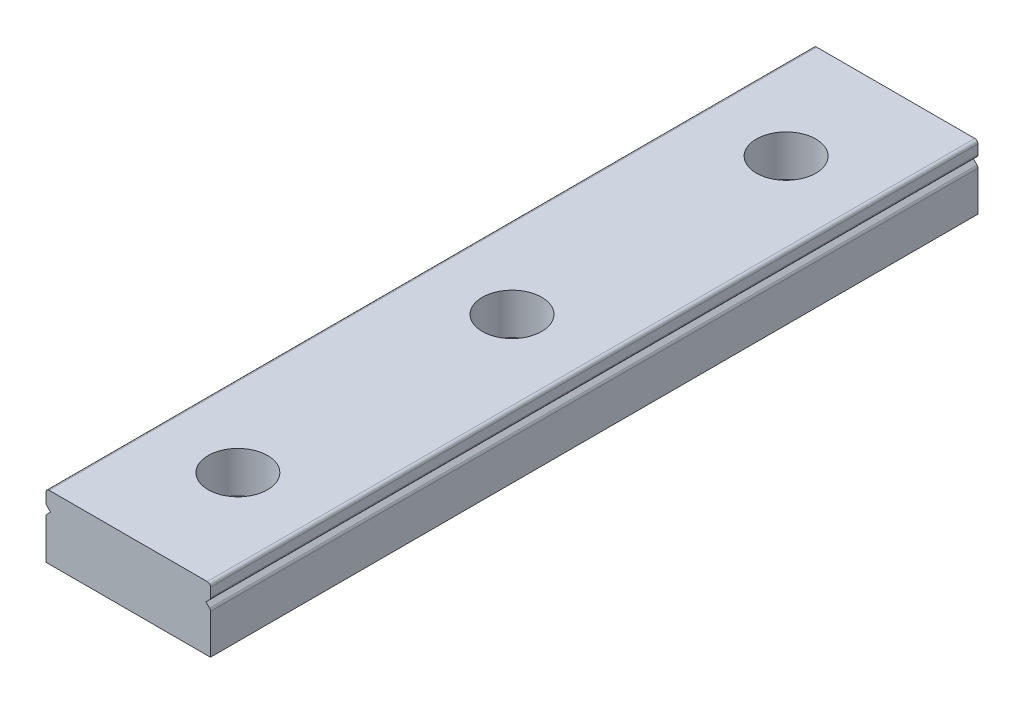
from build123d import *

# Parameters (mm, degrees)
EXTRUDE3_DEPTH                  = 84
FILLET1_R                       = 0.35
FILLET1_OF_MIRROR1_R            = 0.35
CBORE_FOR_M3_SBHCS1_D           = 3.5
CBORE_FOR_M3_SBHCS1_CBORE_D     = 6.5
CBORE_FOR_M3_SBHCS1_CBORE_DEPTH = 4.5
LPATTERN3_COUNT                 = 3
LPATTERN3_PITCH                 = 30


with BuildPart() as part:
    # Sketch2 → Extrude3 (new body)
    with BuildSketch(Plane.XY):
        Polygon((8.5, 5), (9, 4.5), (9, 0), (0, 0), (0, 7), (9, 7), (9, 5.5), align=None)
    extrude3 = extrude(amount=EXTRUDE3_DEPTH)

    # Fillet1
    fillet1_edges = [part.edges().sort_by_distance(p)[0] for p in [
        (9, 7, 42),
        (9, 5.5, 42),
        (9, 4.5, 42),
    ]]
    fillet(fillet1_edges, radius=FILLET1_R)

    # Mirror1: Extrude3 across plane
    add(extrude3.mirror(Plane(origin=(0, 0, 0), x_dir=(0, 0, 1), z_dir=(1, 0, 0))))

    # Fillet1 of Mirror1
    fillet1_of_mirror1_edges = [part.edges().sort_by_distance(p)[0] for p in [
        (-9, 7, 42),
        (-9, 5.5, 42),
        (-9, 4.5, 42),
    ]]
    fillet(fillet1_of_mirror1_edges, radius=FILLET1_OF_MIRROR1_R)

    # CBORE for M3 SBHCS1 (through all)
    with Locations(Plane(origin=(0, 7, 0), x_dir=(-1, 0, 0), z_dir=(0, 1, 0))):
        with Locations((0, 12)):
            cbore_for_m3_sbhcs1 = CounterBoreHole(CBORE_FOR_M3_SBHCS1_D / 2, CBORE_FOR_M3_SBHCS1_CBORE_D / 2, CBORE_FOR_M3_SBHCS1_CBORE_DEPTH)

    # LPattern3: CBORE for M3 SBHCS1 ×3
    with Locations(*[(0, 0, i * LPATTERN3_PITCH) for i in range(1, LPATTERN3_COUNT)]):
        add(cbore_for_m3_sbhcs1, mode=Mode.SUBTRACT)


solid = part.part
